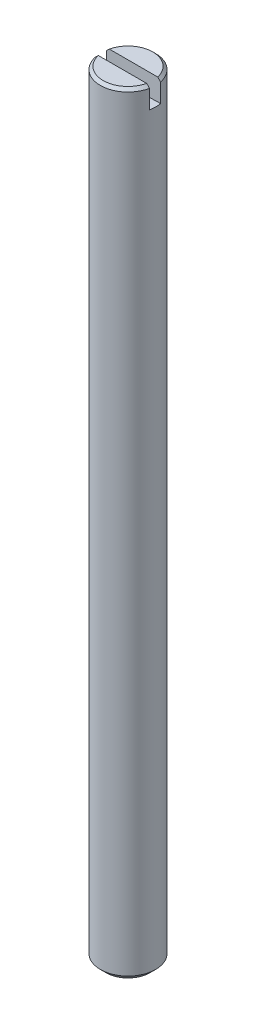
ISO-10303-21;
HEADER;
FILE_DESCRIPTION(('STEP AP214'),'2;1');
FILE_NAME('part.step','',(''),(''),'','','');
FILE_SCHEMA(('AUTOMOTIVE_DESIGN { 1 0 10303 214 1 1 1 1 }'));
ENDSEC;
DATA;
#1=APPLICATION_CONTEXT('core data for automotive mechanical design processes');
#2=APPLICATION_PROTOCOL_DEFINITION('international standard','automotive_design',2000,#1);
#3=PRODUCT_CONTEXT('',#1,'mechanical');
#4=PRODUCT('Part','Part','',(#3));
#5=PRODUCT_RELATED_PRODUCT_CATEGORY('part','',(#4));
#6=PRODUCT_DEFINITION_FORMATION('','',#4);
#7=PRODUCT_DEFINITION_CONTEXT('part definition',#1,'design');
#8=PRODUCT_DEFINITION('design','',#6,#7);
#9=PRODUCT_DEFINITION_SHAPE('','',#8);
#10=(LENGTH_UNIT() NAMED_UNIT(*) SI_UNIT(.MILLI.,.METRE.));
#11=(NAMED_UNIT(*) PLANE_ANGLE_UNIT() SI_UNIT($,.RADIAN.));
#12=(NAMED_UNIT(*) SI_UNIT($,.STERADIAN.) SOLID_ANGLE_UNIT());
#13=UNCERTAINTY_MEASURE_WITH_UNIT(LENGTH_MEASURE(1.E-05),#10,'distance_accuracy_value','');
#14=(GEOMETRIC_REPRESENTATION_CONTEXT(3) GLOBAL_UNCERTAINTY_ASSIGNED_CONTEXT((#13)) GLOBAL_UNIT_ASSIGNED_CONTEXT((#10,
#11,#12)) REPRESENTATION_CONTEXT('',''));
#15=CARTESIAN_POINT('',(0.,0.,0.));
#16=DIRECTION('',(0.,0.,1.));
#17=DIRECTION('',(1.,0.,0.));
#18=AXIS2_PLACEMENT_3D('',#15,#16,#17);
#19=CARTESIAN_POINT('',(0.,22.,0.));
#20=DIRECTION('',(0.,-1.,0.));
#21=DIRECTION('',(0.,0.,-1.));
#22=AXIS2_PLACEMENT_3D('',#19,#20,#21);
#23=PLANE('',#22);
#24=CARTESIAN_POINT('',(0.,21.9999999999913,0.));
#25=DIRECTION('',(0.,-1.,0.));
#26=DIRECTION('',(0.,0.,-1.));
#27=AXIS2_PLACEMENT_3D('',#24,#25,#26);
#28=CIRCLE('',#27,1.34650000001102);
#29=CARTESIAN_POINT('',(-1.31265465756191,21.9999999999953,-0.3));
#30=VERTEX_POINT('',#29);
#31=CARTESIAN_POINT('',(1.31265465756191,21.9999999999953,-0.3));
#32=VERTEX_POINT('',#31);
#33=EDGE_CURVE('E166',#30,#32,#28,.T.);
#34=ORIENTED_EDGE('',*,*,#33,.F.);
#35=DIRECTION('',(1.,0.,0.));
#36=VECTOR('',#35,1.);
#37=CARTESIAN_POINT('',(0.,22.,-0.3));
#38=LINE('',#37,#36);
#39=EDGE_CURVE('E164',#32,#30,#38,.F.);
#40=ORIENTED_EDGE('',*,*,#39,.F.);
#41=EDGE_LOOP('',(#34,#40));
#42=FACE_BOUND('',#41,.T.);
#43=ADVANCED_FACE('F15',(#42),#23,.F.);
#44=CARTESIAN_POINT('',(0.,22.,0.));
#45=DIRECTION('',(0.,-1.,0.));
#46=DIRECTION('',(0.,0.,-1.));
#47=AXIS2_PLACEMENT_3D('',#44,#45,#46);
#48=PLANE('',#47);
#49=DIRECTION('',(1.,0.,0.));
#50=VECTOR('',#49,1.);
#51=CARTESIAN_POINT('',(0.,22.,0.3));
#52=LINE('',#51,#50);
#53=CARTESIAN_POINT('',(-1.31265465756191,21.9999999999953,0.3));
#54=VERTEX_POINT('',#53);
#55=CARTESIAN_POINT('',(1.31265465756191,21.9999999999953,0.3));
#56=VERTEX_POINT('',#55);
#57=EDGE_CURVE('E162',#54,#56,#52,.T.);
#58=ORIENTED_EDGE('',*,*,#57,.F.);
#59=CARTESIAN_POINT('',(0.,21.9999999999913,0.));
#60=DIRECTION('',(0.,-1.,0.));
#61=DIRECTION('',(0.,0.,-1.));
#62=AXIS2_PLACEMENT_3D('',#59,#60,#61);
#63=CIRCLE('',#62,1.34650000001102);
#64=EDGE_CURVE('E160',#56,#54,#63,.T.);
#65=ORIENTED_EDGE('',*,*,#64,.F.);
#66=EDGE_LOOP('',(#58,#65));
#67=FACE_BOUND('',#66,.T.);
#68=ADVANCED_FACE('F122',(#67),#48,.F.);
#69=CARTESIAN_POINT('',(0.,21.846499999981,0.));
#70=DIRECTION('',(0.,-1.,0.));
#71=DIRECTION('',(0.,0.,-1.));
#72=AXIS2_PLACEMENT_3D('',#69,#70,#71);
#73=CONICAL_SURFACE('',#72,1.50000000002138,0.785398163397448);
#74=CARTESIAN_POINT('',(-1.31265465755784,21.9999999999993,-0.3));
#75=CARTESIAN_POINT('',(-1.33886002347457,21.9744495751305,-0.3));
#76=CARTESIAN_POINT('',(-1.36504930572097,21.9488826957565,-0.3));
#77=CARTESIAN_POINT('',(-1.41739570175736,21.8977160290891,-0.3));
#78=CARTESIAN_POINT('',(-1.44355281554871,21.872116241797,-0.3));
#79=CARTESIAN_POINT('',(-1.4696938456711,21.8465000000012,-0.3));
#80=B_SPLINE_CURVE_WITH_KNOTS('',3,(#74,#75,#76,#77,#78,#79),.UNSPECIFIED.,.F.,.F.,(4,2,4),(0.,
0.109799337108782,0.219598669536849),.UNSPECIFIED.);
#81=CARTESIAN_POINT('',(-1.46969384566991,21.8465000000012,-0.3));
#82=VERTEX_POINT('',#81);
#83=EDGE_CURVE('E40',#30,#82,#80,.T.);
#84=ORIENTED_EDGE('',*,*,#83,.F.);
#85=ORIENTED_EDGE('',*,*,#33,.T.);
#86=CARTESIAN_POINT('',(1.46969384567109,21.8465000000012,-0.3));
#87=CARTESIAN_POINT('',(1.4435528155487,21.872116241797,-0.3));
#88=CARTESIAN_POINT('',(1.41739570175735,21.8977160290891,-0.3));
#89=CARTESIAN_POINT('',(1.36504930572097,21.9488826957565,-0.3));
#90=CARTESIAN_POINT('',(1.33886002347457,21.9744495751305,-0.3));
#91=CARTESIAN_POINT('',(1.31265465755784,21.9999999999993,-0.3));
#92=B_SPLINE_CURVE_WITH_KNOTS('',3,(#86,#87,#88,#89,#90,#91),.UNSPECIFIED.,.F.,.F.,(4,2,4),(0.,
0.109799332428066,0.219598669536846),.UNSPECIFIED.);
#93=CARTESIAN_POINT('',(1.4696938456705,21.8465000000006,-0.3));
#94=VERTEX_POINT('',#93);
#95=EDGE_CURVE('E135',#94,#32,#92,.T.);
#96=ORIENTED_EDGE('',*,*,#95,.F.);
#97=CARTESIAN_POINT('',(0.,21.8465,0.));
#98=DIRECTION('',(0.,-1.,0.));
#99=DIRECTION('',(0.,0.,-1.));
#100=AXIS2_PLACEMENT_3D('',#97,#98,#99);
#101=CIRCLE('',#100,1.5);
#102=EDGE_CURVE('E10',#82,#94,#101,.T.);
#103=ORIENTED_EDGE('',*,*,#102,.F.);
#104=EDGE_LOOP('',(#84,#85,#96,#103));
#105=FACE_BOUND('',#104,.T.);
#106=ADVANCED_FACE('F117',(#105),#73,.T.);
#107=CARTESIAN_POINT('',(0.,52.3,-0.3));
#108=DIRECTION('',(0.,0.,1.));
#109=DIRECTION('',(1.,0.,0.));
#110=AXIS2_PLACEMENT_3D('',#107,#108,#109);
#111=PLANE('',#110);
#112=ORIENTED_EDGE('',*,*,#39,.T.);
#113=ORIENTED_EDGE('',*,*,#83,.T.);
#114=DIRECTION('',(0.,1.,0.));
#115=VECTOR('',#114,1.);
#116=CARTESIAN_POINT('',(-1.46969384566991,52.3,-0.3));
#117=LINE('',#116,#115);
#118=CARTESIAN_POINT('',(-1.46969384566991,20.8343043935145,-0.3));
#119=VERTEX_POINT('',#118);
#120=EDGE_CURVE('E155',#82,#119,#117,.F.);
#121=ORIENTED_EDGE('',*,*,#120,.T.);
#122=CARTESIAN_POINT('',(0.,52.3,-0.3));
#123=DIRECTION('',(0.,0.,-1.));
#124=DIRECTION('',(-1.,0.,0.));
#125=AXIS2_PLACEMENT_3D('',#122,#123,#124);
#126=CIRCLE('',#125,31.5);
#127=CARTESIAN_POINT('',(1.46969384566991,20.8343043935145,-0.3));
#128=VERTEX_POINT('',#127);
#129=EDGE_CURVE('E89',#119,#128,#126,.F.);
#130=ORIENTED_EDGE('',*,*,#129,.T.);
#131=DIRECTION('',(0.,1.,0.));
#132=VECTOR('',#131,1.);
#133=CARTESIAN_POINT('',(1.46969384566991,52.3,-0.3));
#134=LINE('',#133,#132);
#135=EDGE_CURVE('E141',#128,#94,#134,.T.);
#136=ORIENTED_EDGE('',*,*,#135,.T.);
#137=ORIENTED_EDGE('',*,*,#95,.T.);
#138=EDGE_LOOP('',(#112,#113,#121,#130,#136,#137));
#139=FACE_BOUND('',#138,.T.);
#140=ADVANCED_FACE('F121',(#139),#111,.T.);
#141=CARTESIAN_POINT('',(0.,21.846499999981,0.));
#142=DIRECTION('',(0.,-1.,0.));
#143=DIRECTION('',(0.,0.,-1.));
#144=AXIS2_PLACEMENT_3D('',#141,#142,#143);
#145=CONICAL_SURFACE('',#144,1.50000000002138,0.785398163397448);
#146=ORIENTED_EDGE('',*,*,#64,.T.);
#147=CARTESIAN_POINT('',(-1.31265465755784,21.9999999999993,0.3));
#148=CARTESIAN_POINT('',(-1.33886002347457,21.9744495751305,0.3));
#149=CARTESIAN_POINT('',(-1.36504930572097,21.9488826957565,0.3));
#150=CARTESIAN_POINT('',(-1.41739570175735,21.8977160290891,0.3));
#151=CARTESIAN_POINT('',(-1.4435528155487,21.872116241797,0.3));
#152=CARTESIAN_POINT('',(-1.46969384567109,21.8465000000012,0.3));
#153=B_SPLINE_CURVE_WITH_KNOTS('',3,(#147,#148,#149,#150,#151,#152),.UNSPECIFIED.,.F.,.F.,(4,2,
4),(0.,0.109799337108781,0.219598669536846),.UNSPECIFIED.);
#154=CARTESIAN_POINT('',(-1.4696938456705,21.8465000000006,0.3));
#155=VERTEX_POINT('',#154);
#156=EDGE_CURVE('E150',#54,#155,#153,.T.);
#157=ORIENTED_EDGE('',*,*,#156,.T.);
#158=CARTESIAN_POINT('',(0.,21.8465,0.));
#159=DIRECTION('',(0.,-1.,0.));
#160=DIRECTION('',(0.,0.,-1.));
#161=AXIS2_PLACEMENT_3D('',#158,#159,#160);
#162=CIRCLE('',#161,1.5);
#163=CARTESIAN_POINT('',(1.46969384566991,21.8465000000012,0.3));
#164=VERTEX_POINT('',#163);
#165=EDGE_CURVE('E31',#164,#155,#162,.T.);
#166=ORIENTED_EDGE('',*,*,#165,.F.);
#167=CARTESIAN_POINT('',(1.4696938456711,21.8465000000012,0.3));
#168=CARTESIAN_POINT('',(1.44355281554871,21.872116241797,0.3));
#169=CARTESIAN_POINT('',(1.41739570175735,21.8977160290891,0.3));
#170=CARTESIAN_POINT('',(1.36504930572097,21.9488826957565,0.3));
#171=CARTESIAN_POINT('',(1.33886002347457,21.9744495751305,0.3));
#172=CARTESIAN_POINT('',(1.31265465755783,21.9999999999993,0.3));
#173=B_SPLINE_CURVE_WITH_KNOTS('',3,(#167,#168,#169,#170,#171,#172),.UNSPECIFIED.,.F.,.F.,(4,2,
4),(0.,0.109799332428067,0.219598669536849),.UNSPECIFIED.);
#174=EDGE_CURVE('E97',#164,#56,#173,.T.);
#175=ORIENTED_EDGE('',*,*,#174,.T.);
#176=EDGE_LOOP('',(#146,#157,#166,#175));
#177=FACE_BOUND('',#176,.T.);
#178=ADVANCED_FACE('F123',(#177),#145,.T.);
#179=CARTESIAN_POINT('',(0.,52.3,0.3));
#180=DIRECTION('',(0.,0.,1.));
#181=DIRECTION('',(1.,0.,0.));
#182=AXIS2_PLACEMENT_3D('',#179,#180,#181);
#183=PLANE('',#182);
#184=ORIENTED_EDGE('',*,*,#57,.T.);
#185=ORIENTED_EDGE('',*,*,#174,.F.);
#186=DIRECTION('',(0.,1.,0.));
#187=VECTOR('',#186,1.);
#188=CARTESIAN_POINT('',(1.46969384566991,52.3,0.3));
#189=LINE('',#188,#187);
#190=CARTESIAN_POINT('',(1.46969384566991,20.8343043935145,0.3));
#191=VERTEX_POINT('',#190);
#192=EDGE_CURVE('E95',#191,#164,#189,.T.);
#193=ORIENTED_EDGE('',*,*,#192,.F.);
#194=CARTESIAN_POINT('',(0.,52.3,0.3));
#195=DIRECTION('',(0.,0.,-1.));
#196=DIRECTION('',(-1.,0.,0.));
#197=AXIS2_PLACEMENT_3D('',#194,#195,#196);
#198=CIRCLE('',#197,31.5);
#199=CARTESIAN_POINT('',(-1.46969384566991,20.8343043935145,0.3));
#200=VERTEX_POINT('',#199);
#201=EDGE_CURVE('E82',#200,#191,#198,.F.);
#202=ORIENTED_EDGE('',*,*,#201,.F.);
#203=DIRECTION('',(0.,1.,0.));
#204=VECTOR('',#203,1.);
#205=CARTESIAN_POINT('',(-1.46969384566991,52.3,0.3));
#206=LINE('',#205,#204);
#207=EDGE_CURVE('E74',#155,#200,#206,.F.);
#208=ORIENTED_EDGE('',*,*,#207,.F.);
#209=ORIENTED_EDGE('',*,*,#156,.F.);
#210=EDGE_LOOP('',(#184,#185,#193,#202,#208,#209));
#211=FACE_BOUND('',#210,.T.);
#212=ADVANCED_FACE('F93',(#211),#183,.F.);
#213=CARTESIAN_POINT('',(0.,52.3,0.3));
#214=DIRECTION('',(0.,0.,-1.));
#215=DIRECTION('',(-1.,0.,0.));
#216=AXIS2_PLACEMENT_3D('',#213,#214,#215);
#217=CYLINDRICAL_SURFACE('',#216,31.5);
#218=CARTESIAN_POINT('',(1.46969384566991,20.8343043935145,-0.3));
#219=CARTESIAN_POINT('',(1.47819327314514,20.8347020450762,-0.258385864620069));
#220=CARTESIAN_POINT('',(1.48491598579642,20.8350188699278,-0.216408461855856));
#221=CARTESIAN_POINT('',(1.49478157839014,20.8354856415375,-0.132020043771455));
#222=CARTESIAN_POINT('',(1.49792328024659,20.8356355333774,-0.0896088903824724));
#223=CARTESIAN_POINT('',(1.50057258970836,20.8357618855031,-0.00538043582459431));
#224=CARTESIAN_POINT('',(1.50013980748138,20.8357411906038,0.036435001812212));
#225=CARTESIAN_POINT('',(1.49578575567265,20.8355338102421,0.119866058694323));
#226=CARTESIAN_POINT('',(1.49186606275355,20.835347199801,0.161481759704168));
#227=CARTESIAN_POINT('',(1.48177716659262,20.8348708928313,0.235411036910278));
#228=CARTESIAN_POINT('',(1.47626595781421,20.8346116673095,0.267815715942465));
#229=CARTESIAN_POINT('',(1.46969384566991,20.8343043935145,0.3));
#230=B_SPLINE_CURVE_WITH_KNOTS('',3,(#218,#219,#220,#221,#222,#223,#224,#225,#226,#227,#228,
#229),.UNSPECIFIED.,.F.,.F.,(4,2,2,2,2,4),(0.,0.127386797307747,0.254815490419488,
0.380123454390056,0.505374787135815,0.603915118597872),.UNSPECIFIED.);
#231=EDGE_CURVE('E83',#128,#191,#230,.T.);
#232=ORIENTED_EDGE('',*,*,#231,.F.);
#233=ORIENTED_EDGE('',*,*,#129,.F.);
#234=CARTESIAN_POINT('',(-1.46969384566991,20.8343043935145,0.3));
#235=CARTESIAN_POINT('',(-1.47819327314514,20.8347020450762,0.258385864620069));
#236=CARTESIAN_POINT('',(-1.48491598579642,20.8350188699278,0.216408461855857));
#237=CARTESIAN_POINT('',(-1.49478157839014,20.8354856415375,0.132020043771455));
#238=CARTESIAN_POINT('',(-1.49792328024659,20.8356355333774,0.089608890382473));
#239=CARTESIAN_POINT('',(-1.50057258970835,20.8357618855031,0.00538043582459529));
#240=CARTESIAN_POINT('',(-1.50013980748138,20.8357411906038,-0.0364350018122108));
#241=CARTESIAN_POINT('',(-1.49578575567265,20.8355338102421,-0.119866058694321));
#242=CARTESIAN_POINT('',(-1.49186606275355,20.835347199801,-0.161481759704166));
#243=CARTESIAN_POINT('',(-1.48177716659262,20.8348708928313,-0.235411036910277));
#244=CARTESIAN_POINT('',(-1.47626595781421,20.8346116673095,-0.267815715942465));
#245=CARTESIAN_POINT('',(-1.46969384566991,20.8343043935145,-0.3));
#246=B_SPLINE_CURVE_WITH_KNOTS('',3,(#234,#235,#236,#237,#238,#239,#240,#241,#242,#243,#244,
#245),.UNSPECIFIED.,.F.,.F.,(4,2,2,2,2,4),(0.,0.127386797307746,0.254815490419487,
0.380123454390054,0.505374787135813,0.603915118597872),.UNSPECIFIED.);
#247=EDGE_CURVE('E20',#200,#119,#246,.T.);
#248=ORIENTED_EDGE('',*,*,#247,.F.);
#249=ORIENTED_EDGE('',*,*,#201,.T.);
#250=EDGE_LOOP('',(#232,#233,#248,#249));
#251=FACE_BOUND('',#250,.T.);
#252=ADVANCED_FACE('F17',(#251),#217,.F.);
#253=CARTESIAN_POINT('',(0.,15.,0.));
#254=DIRECTION('',(0.,-1.,0.));
#255=DIRECTION('',(0.,0.,-1.));
#256=AXIS2_PLACEMENT_3D('',#253,#254,#255);
#257=CYLINDRICAL_SURFACE('',#256,1.5);
#258=ORIENTED_EDGE('',*,*,#231,.T.);
#259=ORIENTED_EDGE('',*,*,#192,.T.);
#260=ORIENTED_EDGE('',*,*,#165,.T.);
#261=ORIENTED_EDGE('',*,*,#207,.T.);
#262=ORIENTED_EDGE('',*,*,#247,.T.);
#263=ORIENTED_EDGE('',*,*,#120,.F.);
#264=ORIENTED_EDGE('',*,*,#102,.T.);
#265=ORIENTED_EDGE('',*,*,#135,.F.);
#266=EDGE_LOOP('',(#258,#259,#260,#261,#262,#263,#264,#265));
#267=FACE_BOUND('',#266,.T.);
#268=CARTESIAN_POINT('',(0.,-19.6935,0.));
#269=DIRECTION('',(0.,-1.,0.));
#270=DIRECTION('',(0.,0.,-1.));
#271=AXIS2_PLACEMENT_3D('',#268,#269,#270);
#272=CIRCLE('',#271,1.5);
#273=CARTESIAN_POINT('',(0.,-19.6935,-1.5));
#274=VERTEX_POINT('',#273);
#275=EDGE_CURVE('E173',#274,#274,#272,.F.);
#276=ORIENTED_EDGE('',*,*,#275,.T.);
#277=EDGE_LOOP('',(#276));
#278=FACE_BOUND('',#277,.T.);
#279=ADVANCED_FACE('F76',(#267,#278),#257,.T.);
#280=CARTESIAN_POINT('',(1.1935,-20.,0.));
#281=DIRECTION('',(0.,1.,0.));
#282=DIRECTION('',(0.,0.,1.));
#283=AXIS2_PLACEMENT_3D('',#280,#281,#282);
#284=PLANE('',#283);
#285=CARTESIAN_POINT('',(0.,-20.,0.));
#286=DIRECTION('',(0.,1.,0.));
#287=DIRECTION('',(0.,0.,1.));
#288=AXIS2_PLACEMENT_3D('',#285,#286,#287);
#289=CIRCLE('',#288,1.19350000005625);
#290=CARTESIAN_POINT('',(0.,-20.,1.19350000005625));
#291=VERTEX_POINT('',#290);
#292=EDGE_CURVE('E91',#291,#291,#289,.T.);
#293=ORIENTED_EDGE('',*,*,#292,.F.);
#294=EDGE_LOOP('',(#293));
#295=FACE_BOUND('',#294,.T.);
#296=ADVANCED_FACE('F114',(#295),#284,.F.);
#297=CARTESIAN_POINT('',(0.,-19.6935000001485,0.));
#298=DIRECTION('',(0.,1.,0.));
#299=DIRECTION('',(0.,0.,1.));
#300=AXIS2_PLACEMENT_3D('',#297,#298,#299);
#301=CONICAL_SURFACE('',#300,1.49999999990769,0.785398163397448);
#302=ORIENTED_EDGE('',*,*,#275,.F.);
#303=EDGE_LOOP('',(#302));
#304=FACE_BOUND('',#303,.T.);
#305=ORIENTED_EDGE('',*,*,#292,.T.);
#306=EDGE_LOOP('',(#305));
#307=FACE_BOUND('',#306,.T.);
#308=ADVANCED_FACE('F115',(#304,#307),#301,.T.);
#309=CLOSED_SHELL('',(#43,#68,#106,#140,#178,#212,#252,#279,#296,#308));
#310=MANIFOLD_SOLID_BREP('B1',#309);
#311=ADVANCED_BREP_SHAPE_REPRESENTATION('',(#18,#310),#14);
#312=SHAPE_DEFINITION_REPRESENTATION(#9,#311);
ENDSEC;
END-ISO-10303-21;
